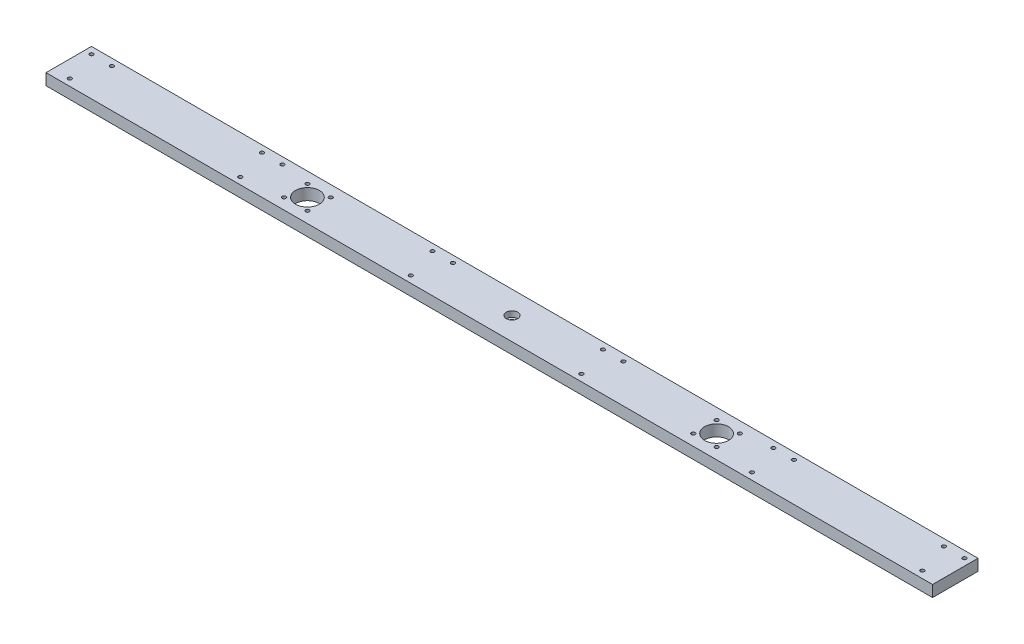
ISO-10303-21;
HEADER;
FILE_DESCRIPTION(('STEP AP214'),'2;1');
FILE_NAME('part.step','',(''),(''),'','','');
FILE_SCHEMA(('AUTOMOTIVE_DESIGN { 1 0 10303 214 1 1 1 1 }'));
ENDSEC;
DATA;
#1=APPLICATION_CONTEXT('core data for automotive mechanical design processes');
#2=APPLICATION_PROTOCOL_DEFINITION('international standard','automotive_design',2000,#1);
#3=PRODUCT_CONTEXT('',#1,'mechanical');
#4=PRODUCT('Part','Part','',(#3));
#5=PRODUCT_RELATED_PRODUCT_CATEGORY('part','',(#4));
#6=PRODUCT_DEFINITION_FORMATION('','',#4);
#7=PRODUCT_DEFINITION_CONTEXT('part definition',#1,'design');
#8=PRODUCT_DEFINITION('design','',#6,#7);
#9=PRODUCT_DEFINITION_SHAPE('','',#8);
#10=(LENGTH_UNIT() NAMED_UNIT(*) SI_UNIT(.MILLI.,.METRE.));
#11=(NAMED_UNIT(*) PLANE_ANGLE_UNIT() SI_UNIT($,.RADIAN.));
#12=(NAMED_UNIT(*) SI_UNIT($,.STERADIAN.) SOLID_ANGLE_UNIT());
#13=UNCERTAINTY_MEASURE_WITH_UNIT(LENGTH_MEASURE(1.E-05),#10,'distance_accuracy_value','');
#14=(GEOMETRIC_REPRESENTATION_CONTEXT(3) GLOBAL_UNCERTAINTY_ASSIGNED_CONTEXT((#13)) GLOBAL_UNIT_ASSIGNED_CONTEXT((#10,
#11,#12)) REPRESENTATION_CONTEXT('',''));
#15=CARTESIAN_POINT('',(0.,0.,0.));
#16=DIRECTION('',(0.,0.,1.));
#17=DIRECTION('',(1.,0.,0.));
#18=AXIS2_PLACEMENT_3D('',#15,#16,#17);
#19=CARTESIAN_POINT('',(0.,5.,0.));
#20=DIRECTION('',(0.,1.,0.));
#21=DIRECTION('',(0.,0.,1.));
#22=AXIS2_PLACEMENT_3D('',#19,#20,#21);
#23=CYLINDRICAL_SURFACE('',#22,5.);
#24=CARTESIAN_POINT('',(0.,10.,0.));
#25=DIRECTION('',(0.,1.,0.));
#26=DIRECTION('',(0.,0.,1.));
#27=AXIS2_PLACEMENT_3D('',#24,#25,#26);
#28=CIRCLE('',#27,5.);
#29=CARTESIAN_POINT('',(0.,10.,5.));
#30=VERTEX_POINT('',#29);
#31=EDGE_CURVE('E253',#30,#30,#28,.F.);
#32=ORIENTED_EDGE('',*,*,#31,.F.);
#33=EDGE_LOOP('',(#32));
#34=FACE_BOUND('',#33,.T.);
#35=CARTESIAN_POINT('',(0.,5.,0.));
#36=DIRECTION('',(0.,1.,0.));
#37=DIRECTION('',(0.,0.,1.));
#38=AXIS2_PLACEMENT_3D('',#35,#36,#37);
#39=CIRCLE('',#38,5.);
#40=CARTESIAN_POINT('',(0.,5.,5.));
#41=VERTEX_POINT('',#40);
#42=EDGE_CURVE('E20',#41,#41,#39,.T.);
#43=ORIENTED_EDGE('',*,*,#42,.F.);
#44=EDGE_LOOP('',(#43));
#45=FACE_BOUND('',#44,.T.);
#46=ADVANCED_FACE('F17',(#34,#45),#23,.F.);
#47=CARTESIAN_POINT('',(0.,5.,0.));
#48=DIRECTION('',(0.,1.,0.));
#49=DIRECTION('',(0.,0.,1.));
#50=AXIS2_PLACEMENT_3D('',#47,#48,#49);
#51=PLANE('',#50);
#52=CARTESIAN_POINT('',(0.,5.,0.));
#53=DIRECTION('',(0.,1.,0.));
#54=DIRECTION('',(0.,0.,1.));
#55=AXIS2_PLACEMENT_3D('',#52,#53,#54);
#56=CIRCLE('',#55,2.75);
#57=CARTESIAN_POINT('',(0.,5.,2.75));
#58=VERTEX_POINT('',#57);
#59=EDGE_CURVE('E68',#58,#58,#56,.F.);
#60=ORIENTED_EDGE('',*,*,#59,.T.);
#61=EDGE_LOOP('',(#60));
#62=FACE_BOUND('',#61,.T.);
#63=ORIENTED_EDGE('',*,*,#42,.T.);
#64=EDGE_LOOP('',(#63));
#65=FACE_BOUND('',#64,.T.);
#66=ADVANCED_FACE('F259',(#62,#65),#51,.T.);
#67=CARTESIAN_POINT('',(0.,10.,0.));
#68=DIRECTION('',(0.,1.,0.));
#69=DIRECTION('',(0.,0.,1.));
#70=AXIS2_PLACEMENT_3D('',#67,#68,#69);
#71=PLANE('',#70);
#72=CARTESIAN_POINT('',(383.999999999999,10.,-14.0000000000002));
#73=DIRECTION('',(0.,1.,0.));
#74=DIRECTION('',(0.,0.,1.));
#75=AXIS2_PLACEMENT_3D('',#72,#73,#74);
#76=CIRCLE('',#75,1.64999999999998);
#77=CARTESIAN_POINT('',(383.999999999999,10.,-12.3500000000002));
#78=VERTEX_POINT('',#77);
#79=EDGE_CURVE('E167',#78,#78,#76,.F.);
#80=ORIENTED_EDGE('',*,*,#79,.T.);
#81=EDGE_LOOP('',(#80));
#82=FACE_BOUND('',#81,.T.);
#83=CARTESIAN_POINT('',(233.999999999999,10.,-14.0000000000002));
#84=DIRECTION('',(0.,1.,0.));
#85=DIRECTION('',(0.,0.,1.));
#86=AXIS2_PLACEMENT_3D('',#83,#84,#85);
#87=CIRCLE('',#86,1.64999999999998);
#88=CARTESIAN_POINT('',(233.999999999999,10.,-12.3500000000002));
#89=VERTEX_POINT('',#88);
#90=EDGE_CURVE('E170',#89,#89,#87,.F.);
#91=ORIENTED_EDGE('',*,*,#90,.T.);
#92=EDGE_LOOP('',(#91));
#93=FACE_BOUND('',#92,.T.);
#94=CARTESIAN_POINT('',(83.9999999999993,10.,-14.0000000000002));
#95=DIRECTION('',(0.,1.,0.));
#96=DIRECTION('',(0.,0.,1.));
#97=AXIS2_PLACEMENT_3D('',#94,#95,#96);
#98=CIRCLE('',#97,1.64999999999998);
#99=CARTESIAN_POINT('',(83.9999999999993,10.,-12.3500000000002));
#100=VERTEX_POINT('',#99);
#101=EDGE_CURVE('E173',#100,#100,#98,.F.);
#102=ORIENTED_EDGE('',*,*,#101,.T.);
#103=EDGE_LOOP('',(#102));
#104=FACE_BOUND('',#103,.T.);
#105=CARTESIAN_POINT('',(-66.0000000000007,10.,-14.0000000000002));
#106=DIRECTION('',(0.,1.,0.));
#107=DIRECTION('',(0.,0.,1.));
#108=AXIS2_PLACEMENT_3D('',#105,#106,#107);
#109=CIRCLE('',#108,1.64999999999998);
#110=CARTESIAN_POINT('',(-66.0000000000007,10.,-12.3500000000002));
#111=VERTEX_POINT('',#110);
#112=EDGE_CURVE('E176',#111,#111,#109,.F.);
#113=ORIENTED_EDGE('',*,*,#112,.T.);
#114=EDGE_LOOP('',(#113));
#115=FACE_BOUND('',#114,.T.);
#116=CARTESIAN_POINT('',(374.999999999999,10.,13.9999999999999));
#117=DIRECTION('',(0.,1.,0.));
#118=DIRECTION('',(0.,0.,1.));
#119=AXIS2_PLACEMENT_3D('',#116,#117,#118);
#120=CIRCLE('',#119,1.64999999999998);
#121=CARTESIAN_POINT('',(374.999999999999,10.,15.6499999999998));
#122=VERTEX_POINT('',#121);
#123=EDGE_CURVE('E179',#122,#122,#120,.F.);
#124=ORIENTED_EDGE('',*,*,#123,.T.);
#125=EDGE_LOOP('',(#124));
#126=FACE_BOUND('',#125,.T.);
#127=CARTESIAN_POINT('',(224.999999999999,10.,13.9999999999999));
#128=DIRECTION('',(0.,1.,0.));
#129=DIRECTION('',(0.,0.,1.));
#130=AXIS2_PLACEMENT_3D('',#127,#128,#129);
#131=CIRCLE('',#130,1.64999999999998);
#132=CARTESIAN_POINT('',(224.999999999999,10.,15.6499999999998));
#133=VERTEX_POINT('',#132);
#134=EDGE_CURVE('E182',#133,#133,#131,.F.);
#135=ORIENTED_EDGE('',*,*,#134,.T.);
#136=EDGE_LOOP('',(#135));
#137=FACE_BOUND('',#136,.T.);
#138=CARTESIAN_POINT('',(74.9999999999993,10.,13.9999999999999));
#139=DIRECTION('',(0.,1.,0.));
#140=DIRECTION('',(0.,0.,1.));
#141=AXIS2_PLACEMENT_3D('',#138,#139,#140);
#142=CIRCLE('',#141,1.64999999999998);
#143=CARTESIAN_POINT('',(74.9999999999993,10.,15.6499999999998));
#144=VERTEX_POINT('',#143);
#145=EDGE_CURVE('E185',#144,#144,#142,.F.);
#146=ORIENTED_EDGE('',*,*,#145,.T.);
#147=EDGE_LOOP('',(#146));
#148=FACE_BOUND('',#147,.T.);
#149=CARTESIAN_POINT('',(-75.0000000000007,10.,13.9999999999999));
#150=DIRECTION('',(0.,1.,0.));
#151=DIRECTION('',(0.,0.,1.));
#152=AXIS2_PLACEMENT_3D('',#149,#150,#151);
#153=CIRCLE('',#152,1.64999999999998);
#154=CARTESIAN_POINT('',(-75.0000000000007,10.,15.6499999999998));
#155=VERTEX_POINT('',#154);
#156=EDGE_CURVE('E188',#155,#155,#153,.F.);
#157=ORIENTED_EDGE('',*,*,#156,.T.);
#158=EDGE_LOOP('',(#157));
#159=FACE_BOUND('',#158,.T.);
#160=CARTESIAN_POINT('',(365.999999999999,10.,-14.0000000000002));
#161=DIRECTION('',(0.,1.,0.));
#162=DIRECTION('',(0.,0.,1.));
#163=AXIS2_PLACEMENT_3D('',#160,#161,#162);
#164=CIRCLE('',#163,1.64999999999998);
#165=CARTESIAN_POINT('',(365.999999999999,10.,-12.3500000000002));
#166=VERTEX_POINT('',#165);
#167=EDGE_CURVE('E191',#166,#166,#164,.F.);
#168=ORIENTED_EDGE('',*,*,#167,.T.);
#169=EDGE_LOOP('',(#168));
#170=FACE_BOUND('',#169,.T.);
#171=CARTESIAN_POINT('',(215.999999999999,10.,-14.0000000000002));
#172=DIRECTION('',(0.,1.,0.));
#173=DIRECTION('',(0.,0.,1.));
#174=AXIS2_PLACEMENT_3D('',#171,#172,#173);
#175=CIRCLE('',#174,1.64999999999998);
#176=CARTESIAN_POINT('',(215.999999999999,10.,-12.3500000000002));
#177=VERTEX_POINT('',#176);
#178=EDGE_CURVE('E194',#177,#177,#175,.F.);
#179=ORIENTED_EDGE('',*,*,#178,.T.);
#180=EDGE_LOOP('',(#179));
#181=FACE_BOUND('',#180,.T.);
#182=CARTESIAN_POINT('',(65.9999999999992,10.,-14.0000000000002));
#183=DIRECTION('',(0.,1.,0.));
#184=DIRECTION('',(0.,0.,1.));
#185=AXIS2_PLACEMENT_3D('',#182,#183,#184);
#186=CIRCLE('',#185,1.64999999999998);
#187=CARTESIAN_POINT('',(65.9999999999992,10.,-12.3500000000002));
#188=VERTEX_POINT('',#187);
#189=EDGE_CURVE('E197',#188,#188,#186,.F.);
#190=ORIENTED_EDGE('',*,*,#189,.T.);
#191=EDGE_LOOP('',(#190));
#192=FACE_BOUND('',#191,.T.);
#193=CARTESIAN_POINT('',(-84.0000000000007,10.,-14.0000000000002));
#194=DIRECTION('',(0.,1.,0.));
#195=DIRECTION('',(0.,0.,1.));
#196=AXIS2_PLACEMENT_3D('',#193,#194,#195);
#197=CIRCLE('',#196,1.64999999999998);
#198=CARTESIAN_POINT('',(-84.0000000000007,10.,-12.3500000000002));
#199=VERTEX_POINT('',#198);
#200=EDGE_CURVE('E200',#199,#199,#197,.F.);
#201=ORIENTED_EDGE('',*,*,#200,.T.);
#202=EDGE_LOOP('',(#201));
#203=FACE_BOUND('',#202,.T.);
#204=DIRECTION('',(0.,0.,-1.));
#205=VECTOR('',#204,1.);
#206=CARTESIAN_POINT('',(-390.,10.,-20.));
#207=LINE('',#206,#205);
#208=CARTESIAN_POINT('',(-390.,10.,-20.));
#209=VERTEX_POINT('',#208);
#210=CARTESIAN_POINT('',(-390.,10.,20.));
#211=VERTEX_POINT('',#210);
#212=EDGE_CURVE('E56',#209,#211,#207,.F.);
#213=ORIENTED_EDGE('',*,*,#212,.T.);
#214=DIRECTION('',(-1.,0.,0.));
#215=VECTOR('',#214,1.);
#216=CARTESIAN_POINT('',(-390.,10.,20.));
#217=LINE('',#216,#215);
#218=CARTESIAN_POINT('',(390.,10.,20.));
#219=VERTEX_POINT('',#218);
#220=EDGE_CURVE('E830',#211,#219,#217,.F.);
#221=ORIENTED_EDGE('',*,*,#220,.T.);
#222=DIRECTION('',(0.,0.,1.));
#223=VECTOR('',#222,1.);
#224=CARTESIAN_POINT('',(390.,10.,-20.));
#225=LINE('',#224,#223);
#226=CARTESIAN_POINT('',(390.,10.,-20.));
#227=VERTEX_POINT('',#226);
#228=EDGE_CURVE('E62',#219,#227,#225,.F.);
#229=ORIENTED_EDGE('',*,*,#228,.T.);
#230=DIRECTION('',(1.,0.,0.));
#231=VECTOR('',#230,1.);
#232=CARTESIAN_POINT('',(-390.,10.,-20.));
#233=LINE('',#232,#231);
#234=EDGE_CURVE('E59',#227,#209,#233,.F.);
#235=ORIENTED_EDGE('',*,*,#234,.T.);
#236=EDGE_LOOP('',(#213,#221,#229,#235));
#237=FACE_BOUND('',#236,.T.);
#238=ORIENTED_EDGE('',*,*,#31,.T.);
#239=EDGE_LOOP('',(#238));
#240=FACE_BOUND('',#239,.T.);
#241=CARTESIAN_POINT('',(-180.,10.,0.));
#242=DIRECTION('',(0.,1.,0.));
#243=DIRECTION('',(0.,0.,1.));
#244=AXIS2_PLACEMENT_3D('',#241,#242,#243);
#245=CIRCLE('',#244,10.5);
#246=CARTESIAN_POINT('',(-180.,10.,10.5));
#247=VERTEX_POINT('',#246);
#248=EDGE_CURVE('E206',#247,#247,#245,.F.);
#249=ORIENTED_EDGE('',*,*,#248,.T.);
#250=EDGE_LOOP('',(#249));
#251=FACE_BOUND('',#250,.T.);
#252=CARTESIAN_POINT('',(180.,10.,0.));
#253=DIRECTION('',(0.,1.,0.));
#254=DIRECTION('',(0.,0.,1.));
#255=AXIS2_PLACEMENT_3D('',#252,#253,#254);
#256=CIRCLE('',#255,10.5);
#257=CARTESIAN_POINT('',(180.,10.,10.5));
#258=VERTEX_POINT('',#257);
#259=EDGE_CURVE('E209',#258,#258,#256,.F.);
#260=ORIENTED_EDGE('',*,*,#259,.T.);
#261=EDGE_LOOP('',(#260));
#262=FACE_BOUND('',#261,.T.);
#263=CARTESIAN_POINT('',(169.746951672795,10.,-10.2530483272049));
#264=DIRECTION('',(0.,1.,0.));
#265=DIRECTION('',(0.,0.,1.));
#266=AXIS2_PLACEMENT_3D('',#263,#264,#265);
#267=CIRCLE('',#266,1.64999999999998);
#268=CARTESIAN_POINT('',(169.746951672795,10.,-8.60304832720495));
#269=VERTEX_POINT('',#268);
#270=EDGE_CURVE('E212',#269,#269,#267,.F.);
#271=ORIENTED_EDGE('',*,*,#270,.T.);
#272=EDGE_LOOP('',(#271));
#273=FACE_BOUND('',#272,.T.);
#274=CARTESIAN_POINT('',(-190.253048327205,10.,-10.253048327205));
#275=DIRECTION('',(0.,1.,0.));
#276=DIRECTION('',(0.,0.,1.));
#277=AXIS2_PLACEMENT_3D('',#274,#275,#276);
#278=CIRCLE('',#277,1.64999999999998);
#279=CARTESIAN_POINT('',(-190.253048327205,10.,-8.60304832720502));
#280=VERTEX_POINT('',#279);
#281=EDGE_CURVE('E215',#280,#280,#278,.F.);
#282=ORIENTED_EDGE('',*,*,#281,.T.);
#283=EDGE_LOOP('',(#282));
#284=FACE_BOUND('',#283,.T.);
#285=CARTESIAN_POINT('',(169.746951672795,10.,10.2469516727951));
#286=DIRECTION('',(0.,1.,0.));
#287=DIRECTION('',(0.,0.,1.));
#288=AXIS2_PLACEMENT_3D('',#285,#286,#287);
#289=CIRCLE('',#288,1.64999999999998);
#290=CARTESIAN_POINT('',(169.746951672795,10.,11.8969516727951));
#291=VERTEX_POINT('',#290);
#292=EDGE_CURVE('E218',#291,#291,#289,.F.);
#293=ORIENTED_EDGE('',*,*,#292,.T.);
#294=EDGE_LOOP('',(#293));
#295=FACE_BOUND('',#294,.T.);
#296=CARTESIAN_POINT('',(-190.253048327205,10.,10.246951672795));
#297=DIRECTION('',(0.,1.,0.));
#298=DIRECTION('',(0.,0.,1.));
#299=AXIS2_PLACEMENT_3D('',#296,#297,#298);
#300=CIRCLE('',#299,1.64999999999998);
#301=CARTESIAN_POINT('',(-190.253048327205,10.,11.896951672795));
#302=VERTEX_POINT('',#301);
#303=EDGE_CURVE('E221',#302,#302,#300,.F.);
#304=ORIENTED_EDGE('',*,*,#303,.T.);
#305=EDGE_LOOP('',(#304));
#306=FACE_BOUND('',#305,.T.);
#307=CARTESIAN_POINT('',(190.246951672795,10.,-10.2530483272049));
#308=DIRECTION('',(0.,1.,0.));
#309=DIRECTION('',(0.,0.,1.));
#310=AXIS2_PLACEMENT_3D('',#307,#308,#309);
#311=CIRCLE('',#310,1.64999999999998);
#312=CARTESIAN_POINT('',(190.246951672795,10.,-8.60304832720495));
#313=VERTEX_POINT('',#312);
#314=EDGE_CURVE('E224',#313,#313,#311,.F.);
#315=ORIENTED_EDGE('',*,*,#314,.T.);
#316=EDGE_LOOP('',(#315));
#317=FACE_BOUND('',#316,.T.);
#318=CARTESIAN_POINT('',(-169.753048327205,10.,-10.253048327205));
#319=DIRECTION('',(0.,1.,0.));
#320=DIRECTION('',(0.,0.,1.));
#321=AXIS2_PLACEMENT_3D('',#318,#319,#320);
#322=CIRCLE('',#321,1.64999999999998);
#323=CARTESIAN_POINT('',(-169.753048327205,10.,-8.60304832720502));
#324=VERTEX_POINT('',#323);
#325=EDGE_CURVE('E227',#324,#324,#322,.F.);
#326=ORIENTED_EDGE('',*,*,#325,.T.);
#327=EDGE_LOOP('',(#326));
#328=FACE_BOUND('',#327,.T.);
#329=CARTESIAN_POINT('',(190.246951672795,10.,10.2469516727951));
#330=DIRECTION('',(0.,1.,0.));
#331=DIRECTION('',(0.,0.,1.));
#332=AXIS2_PLACEMENT_3D('',#329,#330,#331);
#333=CIRCLE('',#332,1.64999999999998);
#334=CARTESIAN_POINT('',(190.246951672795,10.,11.8969516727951));
#335=VERTEX_POINT('',#334);
#336=EDGE_CURVE('E230',#335,#335,#333,.F.);
#337=ORIENTED_EDGE('',*,*,#336,.T.);
#338=EDGE_LOOP('',(#337));
#339=FACE_BOUND('',#338,.T.);
#340=CARTESIAN_POINT('',(-169.753048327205,10.,10.246951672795));
#341=DIRECTION('',(0.,1.,0.));
#342=DIRECTION('',(0.,0.,1.));
#343=AXIS2_PLACEMENT_3D('',#340,#341,#342);
#344=CIRCLE('',#343,1.64999999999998);
#345=CARTESIAN_POINT('',(-169.753048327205,10.,11.896951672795));
#346=VERTEX_POINT('',#345);
#347=EDGE_CURVE('E233',#346,#346,#344,.F.);
#348=ORIENTED_EDGE('',*,*,#347,.T.);
#349=EDGE_LOOP('',(#348));
#350=FACE_BOUND('',#349,.T.);
#351=CARTESIAN_POINT('',(-375.000000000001,10.,13.9999999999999));
#352=DIRECTION('',(0.,1.,0.));
#353=DIRECTION('',(0.,0.,1.));
#354=AXIS2_PLACEMENT_3D('',#351,#352,#353);
#355=CIRCLE('',#354,1.64999999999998);
#356=CARTESIAN_POINT('',(-375.000000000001,10.,15.6499999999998));
#357=VERTEX_POINT('',#356);
#358=EDGE_CURVE('E236',#357,#357,#355,.F.);
#359=ORIENTED_EDGE('',*,*,#358,.T.);
#360=EDGE_LOOP('',(#359));
#361=FACE_BOUND('',#360,.T.);
#362=CARTESIAN_POINT('',(-366.000000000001,10.,-14.0000000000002));
#363=DIRECTION('',(0.,1.,0.));
#364=DIRECTION('',(0.,0.,1.));
#365=AXIS2_PLACEMENT_3D('',#362,#363,#364);
#366=CIRCLE('',#365,1.64999999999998);
#367=CARTESIAN_POINT('',(-366.000000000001,10.,-12.3500000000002));
#368=VERTEX_POINT('',#367);
#369=EDGE_CURVE('E239',#368,#368,#366,.F.);
#370=ORIENTED_EDGE('',*,*,#369,.T.);
#371=EDGE_LOOP('',(#370));
#372=FACE_BOUND('',#371,.T.);
#373=CARTESIAN_POINT('',(-384.000000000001,10.,-14.0000000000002));
#374=DIRECTION('',(0.,1.,0.));
#375=DIRECTION('',(0.,0.,1.));
#376=AXIS2_PLACEMENT_3D('',#373,#374,#375);
#377=CIRCLE('',#376,1.64999999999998);
#378=CARTESIAN_POINT('',(-384.000000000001,10.,-12.3500000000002));
#379=VERTEX_POINT('',#378);
#380=EDGE_CURVE('E242',#379,#379,#377,.F.);
#381=ORIENTED_EDGE('',*,*,#380,.T.);
#382=EDGE_LOOP('',(#381));
#383=FACE_BOUND('',#382,.T.);
#384=CARTESIAN_POINT('',(-234.000000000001,10.,-14.0000000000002));
#385=DIRECTION('',(0.,1.,0.));
#386=DIRECTION('',(0.,0.,1.));
#387=AXIS2_PLACEMENT_3D('',#384,#385,#386);
#388=CIRCLE('',#387,1.64999999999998);
#389=CARTESIAN_POINT('',(-234.000000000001,10.,-12.3500000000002));
#390=VERTEX_POINT('',#389);
#391=EDGE_CURVE('E245',#390,#390,#388,.F.);
#392=ORIENTED_EDGE('',*,*,#391,.T.);
#393=EDGE_LOOP('',(#392));
#394=FACE_BOUND('',#393,.T.);
#395=CARTESIAN_POINT('',(-225.000000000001,10.,13.9999999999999));
#396=DIRECTION('',(0.,1.,0.));
#397=DIRECTION('',(0.,0.,1.));
#398=AXIS2_PLACEMENT_3D('',#395,#396,#397);
#399=CIRCLE('',#398,1.64999999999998);
#400=CARTESIAN_POINT('',(-225.000000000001,10.,15.6499999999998));
#401=VERTEX_POINT('',#400);
#402=EDGE_CURVE('E248',#401,#401,#399,.F.);
#403=ORIENTED_EDGE('',*,*,#402,.T.);
#404=EDGE_LOOP('',(#403));
#405=FACE_BOUND('',#404,.T.);
#406=CARTESIAN_POINT('',(-216.000000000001,10.,-14.0000000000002));
#407=DIRECTION('',(0.,1.,0.));
#408=DIRECTION('',(0.,0.,1.));
#409=AXIS2_PLACEMENT_3D('',#406,#407,#408);
#410=CIRCLE('',#409,1.64999999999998);
#411=CARTESIAN_POINT('',(-216.000000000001,10.,-12.3500000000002));
#412=VERTEX_POINT('',#411);
#413=EDGE_CURVE('E251',#412,#412,#410,.F.);
#414=ORIENTED_EDGE('',*,*,#413,.T.);
#415=EDGE_LOOP('',(#414));
#416=FACE_BOUND('',#415,.T.);
#417=ADVANCED_FACE('F60',(#82,#93,#104,#115,#126,#137,#148,#159,#170,#181,#192,#203,#237,#240,
#251,#262,#273,#284,#295,#306,#317,#328,#339,#350,#361,#372,#383,#394,#405,#416),#71,.T.);
#418=CARTESIAN_POINT('',(-216.000000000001,10.,-14.0000000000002));
#419=DIRECTION('',(0.,1.,0.));
#420=DIRECTION('',(0.,0.,1.));
#421=AXIS2_PLACEMENT_3D('',#418,#419,#420);
#422=CYLINDRICAL_SURFACE('',#421,1.64999999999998);
#423=CARTESIAN_POINT('',(-216.000000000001,0.,-14.0000000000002));
#424=DIRECTION('',(0.,1.,0.));
#425=DIRECTION('',(0.,0.,1.));
#426=AXIS2_PLACEMENT_3D('',#423,#424,#425);
#427=CIRCLE('',#426,1.64999999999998);
#428=CARTESIAN_POINT('',(-216.000000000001,0.,-12.3500000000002));
#429=VERTEX_POINT('',#428);
#430=EDGE_CURVE('E164',#429,#429,#427,.F.);
#431=ORIENTED_EDGE('',*,*,#430,.T.);
#432=EDGE_LOOP('',(#431));
#433=FACE_BOUND('',#432,.T.);
#434=ORIENTED_EDGE('',*,*,#413,.F.);
#435=EDGE_LOOP('',(#434));
#436=FACE_BOUND('',#435,.T.);
#437=ADVANCED_FACE('F399',(#433,#436),#422,.F.);
#438=CARTESIAN_POINT('',(-225.000000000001,10.,13.9999999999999));
#439=DIRECTION('',(0.,1.,0.));
#440=DIRECTION('',(0.,0.,1.));
#441=AXIS2_PLACEMENT_3D('',#438,#439,#440);
#442=CYLINDRICAL_SURFACE('',#441,1.64999999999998);
#443=CARTESIAN_POINT('',(-225.000000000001,0.,13.9999999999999));
#444=DIRECTION('',(0.,1.,0.));
#445=DIRECTION('',(0.,0.,1.));
#446=AXIS2_PLACEMENT_3D('',#443,#444,#445);
#447=CIRCLE('',#446,1.64999999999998);
#448=CARTESIAN_POINT('',(-225.000000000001,0.,15.6499999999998));
#449=VERTEX_POINT('',#448);
#450=EDGE_CURVE('E161',#449,#449,#447,.F.);
#451=ORIENTED_EDGE('',*,*,#450,.T.);
#452=EDGE_LOOP('',(#451));
#453=FACE_BOUND('',#452,.T.);
#454=ORIENTED_EDGE('',*,*,#402,.F.);
#455=EDGE_LOOP('',(#454));
#456=FACE_BOUND('',#455,.T.);
#457=ADVANCED_FACE('F395',(#453,#456),#442,.F.);
#458=CARTESIAN_POINT('',(-234.000000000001,10.,-14.0000000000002));
#459=DIRECTION('',(0.,1.,0.));
#460=DIRECTION('',(0.,0.,1.));
#461=AXIS2_PLACEMENT_3D('',#458,#459,#460);
#462=CYLINDRICAL_SURFACE('',#461,1.64999999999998);
#463=CARTESIAN_POINT('',(-234.000000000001,0.,-14.0000000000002));
#464=DIRECTION('',(0.,1.,0.));
#465=DIRECTION('',(0.,0.,1.));
#466=AXIS2_PLACEMENT_3D('',#463,#464,#465);
#467=CIRCLE('',#466,1.64999999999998);
#468=CARTESIAN_POINT('',(-234.000000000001,0.,-12.3500000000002));
#469=VERTEX_POINT('',#468);
#470=EDGE_CURVE('E158',#469,#469,#467,.F.);
#471=ORIENTED_EDGE('',*,*,#470,.T.);
#472=EDGE_LOOP('',(#471));
#473=FACE_BOUND('',#472,.T.);
#474=ORIENTED_EDGE('',*,*,#391,.F.);
#475=EDGE_LOOP('',(#474));
#476=FACE_BOUND('',#475,.T.);
#477=ADVANCED_FACE('F391',(#473,#476),#462,.F.);
#478=CARTESIAN_POINT('',(-384.000000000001,10.,-14.0000000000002));
#479=DIRECTION('',(0.,1.,0.));
#480=DIRECTION('',(0.,0.,1.));
#481=AXIS2_PLACEMENT_3D('',#478,#479,#480);
#482=CYLINDRICAL_SURFACE('',#481,1.64999999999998);
#483=CARTESIAN_POINT('',(-384.000000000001,0.,-14.0000000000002));
#484=DIRECTION('',(0.,1.,0.));
#485=DIRECTION('',(0.,0.,1.));
#486=AXIS2_PLACEMENT_3D('',#483,#484,#485);
#487=CIRCLE('',#486,1.64999999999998);
#488=CARTESIAN_POINT('',(-384.000000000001,0.,-12.3500000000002));
#489=VERTEX_POINT('',#488);
#490=EDGE_CURVE('E155',#489,#489,#487,.F.);
#491=ORIENTED_EDGE('',*,*,#490,.T.);
#492=EDGE_LOOP('',(#491));
#493=FACE_BOUND('',#492,.T.);
#494=ORIENTED_EDGE('',*,*,#380,.F.);
#495=EDGE_LOOP('',(#494));
#496=FACE_BOUND('',#495,.T.);
#497=ADVANCED_FACE('F387',(#493,#496),#482,.F.);
#498=CARTESIAN_POINT('',(-366.000000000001,10.,-14.0000000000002));
#499=DIRECTION('',(0.,1.,0.));
#500=DIRECTION('',(0.,0.,1.));
#501=AXIS2_PLACEMENT_3D('',#498,#499,#500);
#502=CYLINDRICAL_SURFACE('',#501,1.64999999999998);
#503=CARTESIAN_POINT('',(-366.000000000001,0.,-14.0000000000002));
#504=DIRECTION('',(0.,1.,0.));
#505=DIRECTION('',(0.,0.,1.));
#506=AXIS2_PLACEMENT_3D('',#503,#504,#505);
#507=CIRCLE('',#506,1.64999999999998);
#508=CARTESIAN_POINT('',(-366.000000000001,0.,-12.3500000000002));
#509=VERTEX_POINT('',#508);
#510=EDGE_CURVE('E152',#509,#509,#507,.F.);
#511=ORIENTED_EDGE('',*,*,#510,.T.);
#512=EDGE_LOOP('',(#511));
#513=FACE_BOUND('',#512,.T.);
#514=ORIENTED_EDGE('',*,*,#369,.F.);
#515=EDGE_LOOP('',(#514));
#516=FACE_BOUND('',#515,.T.);
#517=ADVANCED_FACE('F383',(#513,#516),#502,.F.);
#518=CARTESIAN_POINT('',(-375.000000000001,10.,13.9999999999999));
#519=DIRECTION('',(0.,1.,0.));
#520=DIRECTION('',(0.,0.,1.));
#521=AXIS2_PLACEMENT_3D('',#518,#519,#520);
#522=CYLINDRICAL_SURFACE('',#521,1.64999999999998);
#523=CARTESIAN_POINT('',(-375.000000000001,0.,13.9999999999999));
#524=DIRECTION('',(0.,1.,0.));
#525=DIRECTION('',(0.,0.,1.));
#526=AXIS2_PLACEMENT_3D('',#523,#524,#525);
#527=CIRCLE('',#526,1.64999999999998);
#528=CARTESIAN_POINT('',(-375.000000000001,0.,15.6499999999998));
#529=VERTEX_POINT('',#528);
#530=EDGE_CURVE('E149',#529,#529,#527,.F.);
#531=ORIENTED_EDGE('',*,*,#530,.T.);
#532=EDGE_LOOP('',(#531));
#533=FACE_BOUND('',#532,.T.);
#534=ORIENTED_EDGE('',*,*,#358,.F.);
#535=EDGE_LOOP('',(#534));
#536=FACE_BOUND('',#535,.T.);
#537=ADVANCED_FACE('F379',(#533,#536),#522,.F.);
#538=CARTESIAN_POINT('',(-169.753048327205,10.,10.246951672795));
#539=DIRECTION('',(0.,1.,0.));
#540=DIRECTION('',(0.,0.,1.));
#541=AXIS2_PLACEMENT_3D('',#538,#539,#540);
#542=CYLINDRICAL_SURFACE('',#541,1.64999999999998);
#543=CARTESIAN_POINT('',(-169.753048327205,0.,10.246951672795));
#544=DIRECTION('',(0.,1.,0.));
#545=DIRECTION('',(0.,0.,1.));
#546=AXIS2_PLACEMENT_3D('',#543,#544,#545);
#547=CIRCLE('',#546,1.64999999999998);
#548=CARTESIAN_POINT('',(-169.753048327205,0.,11.896951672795));
#549=VERTEX_POINT('',#548);
#550=EDGE_CURVE('E146',#549,#549,#547,.F.);
#551=ORIENTED_EDGE('',*,*,#550,.T.);
#552=EDGE_LOOP('',(#551));
#553=FACE_BOUND('',#552,.T.);
#554=ORIENTED_EDGE('',*,*,#347,.F.);
#555=EDGE_LOOP('',(#554));
#556=FACE_BOUND('',#555,.T.);
#557=ADVANCED_FACE('F375',(#553,#556),#542,.F.);
#558=CARTESIAN_POINT('',(190.246951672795,10.,10.2469516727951));
#559=DIRECTION('',(0.,1.,0.));
#560=DIRECTION('',(0.,0.,1.));
#561=AXIS2_PLACEMENT_3D('',#558,#559,#560);
#562=CYLINDRICAL_SURFACE('',#561,1.64999999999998);
#563=CARTESIAN_POINT('',(190.246951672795,0.,10.2469516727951));
#564=DIRECTION('',(0.,1.,0.));
#565=DIRECTION('',(0.,0.,1.));
#566=AXIS2_PLACEMENT_3D('',#563,#564,#565);
#567=CIRCLE('',#566,1.64999999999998);
#568=CARTESIAN_POINT('',(190.246951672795,0.,11.8969516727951));
#569=VERTEX_POINT('',#568);
#570=EDGE_CURVE('E143',#569,#569,#567,.F.);
#571=ORIENTED_EDGE('',*,*,#570,.T.);
#572=EDGE_LOOP('',(#571));
#573=FACE_BOUND('',#572,.T.);
#574=ORIENTED_EDGE('',*,*,#336,.F.);
#575=EDGE_LOOP('',(#574));
#576=FACE_BOUND('',#575,.T.);
#577=ADVANCED_FACE('F371',(#573,#576),#562,.F.);
#578=CARTESIAN_POINT('',(-169.753048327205,10.,-10.253048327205));
#579=DIRECTION('',(0.,1.,0.));
#580=DIRECTION('',(0.,0.,1.));
#581=AXIS2_PLACEMENT_3D('',#578,#579,#580);
#582=CYLINDRICAL_SURFACE('',#581,1.64999999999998);
#583=CARTESIAN_POINT('',(-169.753048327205,0.,-10.253048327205));
#584=DIRECTION('',(0.,1.,0.));
#585=DIRECTION('',(0.,0.,1.));
#586=AXIS2_PLACEMENT_3D('',#583,#584,#585);
#587=CIRCLE('',#586,1.64999999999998);
#588=CARTESIAN_POINT('',(-169.753048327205,0.,-8.60304832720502));
#589=VERTEX_POINT('',#588);
#590=EDGE_CURVE('E140',#589,#589,#587,.F.);
#591=ORIENTED_EDGE('',*,*,#590,.T.);
#592=EDGE_LOOP('',(#591));
#593=FACE_BOUND('',#592,.T.);
#594=ORIENTED_EDGE('',*,*,#325,.F.);
#595=EDGE_LOOP('',(#594));
#596=FACE_BOUND('',#595,.T.);
#597=ADVANCED_FACE('F367',(#593,#596),#582,.F.);
#598=CARTESIAN_POINT('',(190.246951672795,10.,-10.2530483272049));
#599=DIRECTION('',(0.,1.,0.));
#600=DIRECTION('',(0.,0.,1.));
#601=AXIS2_PLACEMENT_3D('',#598,#599,#600);
#602=CYLINDRICAL_SURFACE('',#601,1.64999999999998);
#603=CARTESIAN_POINT('',(190.246951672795,0.,-10.2530483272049));
#604=DIRECTION('',(0.,1.,0.));
#605=DIRECTION('',(0.,0.,1.));
#606=AXIS2_PLACEMENT_3D('',#603,#604,#605);
#607=CIRCLE('',#606,1.64999999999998);
#608=CARTESIAN_POINT('',(190.246951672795,0.,-8.60304832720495));
#609=VERTEX_POINT('',#608);
#610=EDGE_CURVE('E137',#609,#609,#607,.F.);
#611=ORIENTED_EDGE('',*,*,#610,.T.);
#612=EDGE_LOOP('',(#611));
#613=FACE_BOUND('',#612,.T.);
#614=ORIENTED_EDGE('',*,*,#314,.F.);
#615=EDGE_LOOP('',(#614));
#616=FACE_BOUND('',#615,.T.);
#617=ADVANCED_FACE('F363',(#613,#616),#602,.F.);
#618=CARTESIAN_POINT('',(-190.253048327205,10.,10.246951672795));
#619=DIRECTION('',(0.,1.,0.));
#620=DIRECTION('',(0.,0.,1.));
#621=AXIS2_PLACEMENT_3D('',#618,#619,#620);
#622=CYLINDRICAL_SURFACE('',#621,1.64999999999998);
#623=CARTESIAN_POINT('',(-190.253048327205,0.,10.246951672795));
#624=DIRECTION('',(0.,1.,0.));
#625=DIRECTION('',(0.,0.,1.));
#626=AXIS2_PLACEMENT_3D('',#623,#624,#625);
#627=CIRCLE('',#626,1.64999999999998);
#628=CARTESIAN_POINT('',(-190.253048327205,0.,11.896951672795));
#629=VERTEX_POINT('',#628);
#630=EDGE_CURVE('E134',#629,#629,#627,.F.);
#631=ORIENTED_EDGE('',*,*,#630,.T.);
#632=EDGE_LOOP('',(#631));
#633=FACE_BOUND('',#632,.T.);
#634=ORIENTED_EDGE('',*,*,#303,.F.);
#635=EDGE_LOOP('',(#634));
#636=FACE_BOUND('',#635,.T.);
#637=ADVANCED_FACE('F359',(#633,#636),#622,.F.);
#638=CARTESIAN_POINT('',(169.746951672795,10.,10.2469516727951));
#639=DIRECTION('',(0.,1.,0.));
#640=DIRECTION('',(0.,0.,1.));
#641=AXIS2_PLACEMENT_3D('',#638,#639,#640);
#642=CYLINDRICAL_SURFACE('',#641,1.64999999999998);
#643=CARTESIAN_POINT('',(169.746951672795,0.,10.2469516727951));
#644=DIRECTION('',(0.,1.,0.));
#645=DIRECTION('',(0.,0.,1.));
#646=AXIS2_PLACEMENT_3D('',#643,#644,#645);
#647=CIRCLE('',#646,1.64999999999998);
#648=CARTESIAN_POINT('',(169.746951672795,0.,11.8969516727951));
#649=VERTEX_POINT('',#648);
#650=EDGE_CURVE('E131',#649,#649,#647,.F.);
#651=ORIENTED_EDGE('',*,*,#650,.T.);
#652=EDGE_LOOP('',(#651));
#653=FACE_BOUND('',#652,.T.);
#654=ORIENTED_EDGE('',*,*,#292,.F.);
#655=EDGE_LOOP('',(#654));
#656=FACE_BOUND('',#655,.T.);
#657=ADVANCED_FACE('F355',(#653,#656),#642,.F.);
#658=CARTESIAN_POINT('',(-190.253048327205,10.,-10.253048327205));
#659=DIRECTION('',(0.,1.,0.));
#660=DIRECTION('',(0.,0.,1.));
#661=AXIS2_PLACEMENT_3D('',#658,#659,#660);
#662=CYLINDRICAL_SURFACE('',#661,1.64999999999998);
#663=CARTESIAN_POINT('',(-190.253048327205,0.,-10.253048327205));
#664=DIRECTION('',(0.,1.,0.));
#665=DIRECTION('',(0.,0.,1.));
#666=AXIS2_PLACEMENT_3D('',#663,#664,#665);
#667=CIRCLE('',#666,1.64999999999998);
#668=CARTESIAN_POINT('',(-190.253048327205,0.,-8.60304832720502));
#669=VERTEX_POINT('',#668);
#670=EDGE_CURVE('E128',#669,#669,#667,.F.);
#671=ORIENTED_EDGE('',*,*,#670,.T.);
#672=EDGE_LOOP('',(#671));
#673=FACE_BOUND('',#672,.T.);
#674=ORIENTED_EDGE('',*,*,#281,.F.);
#675=EDGE_LOOP('',(#674));
#676=FACE_BOUND('',#675,.T.);
#677=ADVANCED_FACE('F351',(#673,#676),#662,.F.);
#678=CARTESIAN_POINT('',(169.746951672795,10.,-10.2530483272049));
#679=DIRECTION('',(0.,1.,0.));
#680=DIRECTION('',(0.,0.,1.));
#681=AXIS2_PLACEMENT_3D('',#678,#679,#680);
#682=CYLINDRICAL_SURFACE('',#681,1.64999999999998);
#683=CARTESIAN_POINT('',(169.746951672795,0.,-10.2530483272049));
#684=DIRECTION('',(0.,1.,0.));
#685=DIRECTION('',(0.,0.,1.));
#686=AXIS2_PLACEMENT_3D('',#683,#684,#685);
#687=CIRCLE('',#686,1.64999999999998);
#688=CARTESIAN_POINT('',(169.746951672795,0.,-8.60304832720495));
#689=VERTEX_POINT('',#688);
#690=EDGE_CURVE('E125',#689,#689,#687,.F.);
#691=ORIENTED_EDGE('',*,*,#690,.T.);
#692=EDGE_LOOP('',(#691));
#693=FACE_BOUND('',#692,.T.);
#694=ORIENTED_EDGE('',*,*,#270,.F.);
#695=EDGE_LOOP('',(#694));
#696=FACE_BOUND('',#695,.T.);
#697=ADVANCED_FACE('F347',(#693,#696),#682,.F.);
#698=CARTESIAN_POINT('',(180.,0.,0.));
#699=DIRECTION('',(0.,1.,0.));
#700=DIRECTION('',(0.,0.,1.));
#701=AXIS2_PLACEMENT_3D('',#698,#699,#700);
#702=CYLINDRICAL_SURFACE('',#701,10.5);
#703=CARTESIAN_POINT('',(180.,0.,0.));
#704=DIRECTION('',(0.,1.,0.));
#705=DIRECTION('',(0.,0.,1.));
#706=AXIS2_PLACEMENT_3D('',#703,#704,#705);
#707=CIRCLE('',#706,10.5);
#708=CARTESIAN_POINT('',(180.,0.,10.5));
#709=VERTEX_POINT('',#708);
#710=EDGE_CURVE('E122',#709,#709,#707,.F.);
#711=ORIENTED_EDGE('',*,*,#710,.T.);
#712=EDGE_LOOP('',(#711));
#713=FACE_BOUND('',#712,.T.);
#714=ORIENTED_EDGE('',*,*,#259,.F.);
#715=EDGE_LOOP('',(#714));
#716=FACE_BOUND('',#715,.T.);
#717=ADVANCED_FACE('F343',(#713,#716),#702,.F.);
#718=CARTESIAN_POINT('',(-180.,0.,0.));
#719=DIRECTION('',(0.,1.,0.));
#720=DIRECTION('',(0.,0.,1.));
#721=AXIS2_PLACEMENT_3D('',#718,#719,#720);
#722=CYLINDRICAL_SURFACE('',#721,10.5);
#723=CARTESIAN_POINT('',(-180.,0.,0.));
#724=DIRECTION('',(0.,1.,0.));
#725=DIRECTION('',(0.,0.,1.));
#726=AXIS2_PLACEMENT_3D('',#723,#724,#725);
#727=CIRCLE('',#726,10.5);
#728=CARTESIAN_POINT('',(-180.,0.,10.5));
#729=VERTEX_POINT('',#728);
#730=EDGE_CURVE('E119',#729,#729,#727,.F.);
#731=ORIENTED_EDGE('',*,*,#730,.T.);
#732=EDGE_LOOP('',(#731));
#733=FACE_BOUND('',#732,.T.);
#734=ORIENTED_EDGE('',*,*,#248,.F.);
#735=EDGE_LOOP('',(#734));
#736=FACE_BOUND('',#735,.T.);
#737=ADVANCED_FACE('F339',(#733,#736),#722,.F.);
#738=CARTESIAN_POINT('',(0.,0.,0.));
#739=DIRECTION('',(0.,1.,0.));
#740=DIRECTION('',(0.,0.,1.));
#741=AXIS2_PLACEMENT_3D('',#738,#739,#740);
#742=CYLINDRICAL_SURFACE('',#741,2.75);
#743=CARTESIAN_POINT('',(0.,0.,0.));
#744=DIRECTION('',(0.,1.,0.));
#745=DIRECTION('',(0.,0.,1.));
#746=AXIS2_PLACEMENT_3D('',#743,#744,#745);
#747=CIRCLE('',#746,2.75);
#748=CARTESIAN_POINT('',(0.,0.,2.75));
#749=VERTEX_POINT('',#748);
#750=EDGE_CURVE('E116',#749,#749,#747,.F.);
#751=ORIENTED_EDGE('',*,*,#750,.T.);
#752=EDGE_LOOP('',(#751));
#753=FACE_BOUND('',#752,.T.);
#754=ORIENTED_EDGE('',*,*,#59,.F.);
#755=EDGE_LOOP('',(#754));
#756=FACE_BOUND('',#755,.T.);
#757=ADVANCED_FACE('F336',(#753,#756),#742,.F.);
#758=CARTESIAN_POINT('',(-390.,10.,-20.));
#759=DIRECTION('',(0.,0.,1.));
#760=DIRECTION('',(1.,0.,0.));
#761=AXIS2_PLACEMENT_3D('',#758,#759,#760);
#762=PLANE('',#761);
#763=DIRECTION('',(0.,1.,0.));
#764=VECTOR('',#763,1.);
#765=CARTESIAN_POINT('',(-390.,10.,-20.));
#766=LINE('',#765,#764);
#767=CARTESIAN_POINT('',(-390.,0.,-20.));
#768=VERTEX_POINT('',#767);
#769=EDGE_CURVE('E67',#768,#209,#766,.T.);
#770=ORIENTED_EDGE('',*,*,#769,.T.);
#771=ORIENTED_EDGE('',*,*,#234,.F.);
#772=DIRECTION('',(0.,1.,0.));
#773=VECTOR('',#772,1.);
#774=CARTESIAN_POINT('',(390.,10.,-20.));
#775=LINE('',#774,#773);
#776=CARTESIAN_POINT('',(390.,0.,-20.));
#777=VERTEX_POINT('',#776);
#778=EDGE_CURVE('E203',#227,#777,#775,.F.);
#779=ORIENTED_EDGE('',*,*,#778,.T.);
#780=DIRECTION('',(1.,0.,0.));
#781=VECTOR('',#780,1.);
#782=CARTESIAN_POINT('',(0.,0.,-20.));
#783=LINE('',#782,#781);
#784=EDGE_CURVE('E79',#777,#768,#783,.F.);
#785=ORIENTED_EDGE('',*,*,#784,.T.);
#786=EDGE_LOOP('',(#770,#771,#779,#785));
#787=FACE_BOUND('',#786,.T.);
#788=ADVANCED_FACE('F78',(#787),#762,.F.);
#789=CARTESIAN_POINT('',(-390.,10.,-20.));
#790=DIRECTION('',(1.,0.,0.));
#791=DIRECTION('',(0.,0.,-1.));
#792=AXIS2_PLACEMENT_3D('',#789,#790,#791);
#793=PLANE('',#792);
#794=DIRECTION('',(0.,1.,0.));
#795=VECTOR('',#794,1.);
#796=CARTESIAN_POINT('',(-390.,10.,20.));
#797=LINE('',#796,#795);
#798=CARTESIAN_POINT('',(-390.,0.,20.));
#799=VERTEX_POINT('',#798);
#800=EDGE_CURVE('E75',#799,#211,#797,.T.);
#801=ORIENTED_EDGE('',*,*,#800,.T.);
#802=ORIENTED_EDGE('',*,*,#212,.F.);
#803=ORIENTED_EDGE('',*,*,#769,.F.);
#804=DIRECTION('',(0.,0.,1.));
#805=VECTOR('',#804,1.);
#806=CARTESIAN_POINT('',(-390.,0.,0.));
#807=LINE('',#806,#805);
#808=EDGE_CURVE('E839',#768,#799,#807,.T.);
#809=ORIENTED_EDGE('',*,*,#808,.T.);
#810=EDGE_LOOP('',(#801,#802,#803,#809));
#811=FACE_BOUND('',#810,.T.);
#812=ADVANCED_FACE('F72',(#811),#793,.F.);
#813=CARTESIAN_POINT('',(-390.,10.,20.));
#814=DIRECTION('',(0.,0.,-1.));
#815=DIRECTION('',(-1.,0.,0.));
#816=AXIS2_PLACEMENT_3D('',#813,#814,#815);
#817=PLANE('',#816);
#818=DIRECTION('',(0.,1.,0.));
#819=VECTOR('',#818,1.);
#820=CARTESIAN_POINT('',(390.,10.,20.));
#821=LINE('',#820,#819);
#822=CARTESIAN_POINT('',(390.,0.,20.));
#823=VERTEX_POINT('',#822);
#824=EDGE_CURVE('E35',#823,#219,#821,.T.);
#825=ORIENTED_EDGE('',*,*,#824,.T.);
#826=ORIENTED_EDGE('',*,*,#220,.F.);
#827=ORIENTED_EDGE('',*,*,#800,.F.);
#828=DIRECTION('',(1.,0.,0.));
#829=VECTOR('',#828,1.);
#830=CARTESIAN_POINT('',(0.,0.,20.));
#831=LINE('',#830,#829);
#832=EDGE_CURVE('E832',#799,#823,#831,.T.);
#833=ORIENTED_EDGE('',*,*,#832,.T.);
#834=EDGE_LOOP('',(#825,#826,#827,#833));
#835=FACE_BOUND('',#834,.T.);
#836=ADVANCED_FACE('F328',(#835),#817,.F.);
#837=CARTESIAN_POINT('',(390.,10.,-20.));
#838=DIRECTION('',(-1.,0.,0.));
#839=DIRECTION('',(0.,0.,1.));
#840=AXIS2_PLACEMENT_3D('',#837,#838,#839);
#841=PLANE('',#840);
#842=ORIENTED_EDGE('',*,*,#778,.F.);
#843=ORIENTED_EDGE('',*,*,#228,.F.);
#844=ORIENTED_EDGE('',*,*,#824,.F.);
#845=DIRECTION('',(0.,0.,1.));
#846=VECTOR('',#845,1.);
#847=CARTESIAN_POINT('',(390.,0.,0.));
#848=LINE('',#847,#846);
#849=EDGE_CURVE('E115',#823,#777,#848,.F.);
#850=ORIENTED_EDGE('',*,*,#849,.T.);
#851=EDGE_LOOP('',(#842,#843,#844,#850));
#852=FACE_BOUND('',#851,.T.);
#853=ADVANCED_FACE('F324',(#852),#841,.F.);
#854=CARTESIAN_POINT('',(-84.0000000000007,10.,-14.0000000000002));
#855=DIRECTION('',(0.,1.,0.));
#856=DIRECTION('',(0.,0.,1.));
#857=AXIS2_PLACEMENT_3D('',#854,#855,#856);
#858=CYLINDRICAL_SURFACE('',#857,1.64999999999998);
#859=CARTESIAN_POINT('',(-84.0000000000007,0.,-14.0000000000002));
#860=DIRECTION('',(0.,1.,0.));
#861=DIRECTION('',(0.,0.,1.));
#862=AXIS2_PLACEMENT_3D('',#859,#860,#861);
#863=CIRCLE('',#862,1.64999999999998);
#864=CARTESIAN_POINT('',(-84.0000000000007,0.,-12.3500000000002));
#865=VERTEX_POINT('',#864);
#866=EDGE_CURVE('E112',#865,#865,#863,.F.);
#867=ORIENTED_EDGE('',*,*,#866,.T.);
#868=EDGE_LOOP('',(#867));
#869=FACE_BOUND('',#868,.T.);
#870=ORIENTED_EDGE('',*,*,#200,.F.);
#871=EDGE_LOOP('',(#870));
#872=FACE_BOUND('',#871,.T.);
#873=ADVANCED_FACE('F320',(#869,#872),#858,.F.);
#874=CARTESIAN_POINT('',(65.9999999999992,10.,-14.0000000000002));
#875=DIRECTION('',(0.,1.,0.));
#876=DIRECTION('',(0.,0.,1.));
#877=AXIS2_PLACEMENT_3D('',#874,#875,#876);
#878=CYLINDRICAL_SURFACE('',#877,1.64999999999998);
#879=CARTESIAN_POINT('',(65.9999999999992,0.,-14.0000000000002));
#880=DIRECTION('',(0.,1.,0.));
#881=DIRECTION('',(0.,0.,1.));
#882=AXIS2_PLACEMENT_3D('',#879,#880,#881);
#883=CIRCLE('',#882,1.64999999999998);
#884=CARTESIAN_POINT('',(65.9999999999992,0.,-12.3500000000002));
#885=VERTEX_POINT('',#884);
#886=EDGE_CURVE('E109',#885,#885,#883,.F.);
#887=ORIENTED_EDGE('',*,*,#886,.T.);
#888=EDGE_LOOP('',(#887));
#889=FACE_BOUND('',#888,.T.);
#890=ORIENTED_EDGE('',*,*,#189,.F.);
#891=EDGE_LOOP('',(#890));
#892=FACE_BOUND('',#891,.T.);
#893=ADVANCED_FACE('F316',(#889,#892),#878,.F.);
#894=CARTESIAN_POINT('',(215.999999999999,10.,-14.0000000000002));
#895=DIRECTION('',(0.,1.,0.));
#896=DIRECTION('',(0.,0.,1.));
#897=AXIS2_PLACEMENT_3D('',#894,#895,#896);
#898=CYLINDRICAL_SURFACE('',#897,1.64999999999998);
#899=CARTESIAN_POINT('',(215.999999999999,0.,-14.0000000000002));
#900=DIRECTION('',(0.,1.,0.));
#901=DIRECTION('',(0.,0.,1.));
#902=AXIS2_PLACEMENT_3D('',#899,#900,#901);
#903=CIRCLE('',#902,1.64999999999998);
#904=CARTESIAN_POINT('',(215.999999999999,0.,-12.3500000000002));
#905=VERTEX_POINT('',#904);
#906=EDGE_CURVE('E106',#905,#905,#903,.F.);
#907=ORIENTED_EDGE('',*,*,#906,.T.);
#908=EDGE_LOOP('',(#907));
#909=FACE_BOUND('',#908,.T.);
#910=ORIENTED_EDGE('',*,*,#178,.F.);
#911=EDGE_LOOP('',(#910));
#912=FACE_BOUND('',#911,.T.);
#913=ADVANCED_FACE('F312',(#909,#912),#898,.F.);
#914=CARTESIAN_POINT('',(365.999999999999,10.,-14.0000000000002));
#915=DIRECTION('',(0.,1.,0.));
#916=DIRECTION('',(0.,0.,1.));
#917=AXIS2_PLACEMENT_3D('',#914,#915,#916);
#918=CYLINDRICAL_SURFACE('',#917,1.64999999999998);
#919=CARTESIAN_POINT('',(365.999999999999,0.,-14.0000000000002));
#920=DIRECTION('',(0.,1.,0.));
#921=DIRECTION('',(0.,0.,1.));
#922=AXIS2_PLACEMENT_3D('',#919,#920,#921);
#923=CIRCLE('',#922,1.64999999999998);
#924=CARTESIAN_POINT('',(365.999999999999,0.,-12.3500000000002));
#925=VERTEX_POINT('',#924);
#926=EDGE_CURVE('E103',#925,#925,#923,.F.);
#927=ORIENTED_EDGE('',*,*,#926,.T.);
#928=EDGE_LOOP('',(#927));
#929=FACE_BOUND('',#928,.T.);
#930=ORIENTED_EDGE('',*,*,#167,.F.);
#931=EDGE_LOOP('',(#930));
#932=FACE_BOUND('',#931,.T.);
#933=ADVANCED_FACE('F308',(#929,#932),#918,.F.);
#934=CARTESIAN_POINT('',(-75.0000000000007,10.,13.9999999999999));
#935=DIRECTION('',(0.,1.,0.));
#936=DIRECTION('',(0.,0.,1.));
#937=AXIS2_PLACEMENT_3D('',#934,#935,#936);
#938=CYLINDRICAL_SURFACE('',#937,1.64999999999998);
#939=CARTESIAN_POINT('',(-75.0000000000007,0.,13.9999999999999));
#940=DIRECTION('',(0.,1.,0.));
#941=DIRECTION('',(0.,0.,1.));
#942=AXIS2_PLACEMENT_3D('',#939,#940,#941);
#943=CIRCLE('',#942,1.64999999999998);
#944=CARTESIAN_POINT('',(-75.0000000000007,0.,15.6499999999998));
#945=VERTEX_POINT('',#944);
#946=EDGE_CURVE('E100',#945,#945,#943,.F.);
#947=ORIENTED_EDGE('',*,*,#946,.T.);
#948=EDGE_LOOP('',(#947));
#949=FACE_BOUND('',#948,.T.);
#950=ORIENTED_EDGE('',*,*,#156,.F.);
#951=EDGE_LOOP('',(#950));
#952=FACE_BOUND('',#951,.T.);
#953=ADVANCED_FACE('F304',(#949,#952),#938,.F.);
#954=CARTESIAN_POINT('',(74.9999999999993,10.,13.9999999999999));
#955=DIRECTION('',(0.,1.,0.));
#956=DIRECTION('',(0.,0.,1.));
#957=AXIS2_PLACEMENT_3D('',#954,#955,#956);
#958=CYLINDRICAL_SURFACE('',#957,1.64999999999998);
#959=CARTESIAN_POINT('',(74.9999999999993,0.,13.9999999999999));
#960=DIRECTION('',(0.,1.,0.));
#961=DIRECTION('',(0.,0.,1.));
#962=AXIS2_PLACEMENT_3D('',#959,#960,#961);
#963=CIRCLE('',#962,1.64999999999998);
#964=CARTESIAN_POINT('',(74.9999999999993,0.,15.6499999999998));
#965=VERTEX_POINT('',#964);
#966=EDGE_CURVE('E97',#965,#965,#963,.F.);
#967=ORIENTED_EDGE('',*,*,#966,.T.);
#968=EDGE_LOOP('',(#967));
#969=FACE_BOUND('',#968,.T.);
#970=ORIENTED_EDGE('',*,*,#145,.F.);
#971=EDGE_LOOP('',(#970));
#972=FACE_BOUND('',#971,.T.);
#973=ADVANCED_FACE('F300',(#969,#972),#958,.F.);
#974=CARTESIAN_POINT('',(224.999999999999,10.,13.9999999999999));
#975=DIRECTION('',(0.,1.,0.));
#976=DIRECTION('',(0.,0.,1.));
#977=AXIS2_PLACEMENT_3D('',#974,#975,#976);
#978=CYLINDRICAL_SURFACE('',#977,1.64999999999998);
#979=CARTESIAN_POINT('',(224.999999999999,0.,13.9999999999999));
#980=DIRECTION('',(0.,1.,0.));
#981=DIRECTION('',(0.,0.,1.));
#982=AXIS2_PLACEMENT_3D('',#979,#980,#981);
#983=CIRCLE('',#982,1.64999999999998);
#984=CARTESIAN_POINT('',(224.999999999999,0.,15.6499999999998));
#985=VERTEX_POINT('',#984);
#986=EDGE_CURVE('E94',#985,#985,#983,.F.);
#987=ORIENTED_EDGE('',*,*,#986,.T.);
#988=EDGE_LOOP('',(#987));
#989=FACE_BOUND('',#988,.T.);
#990=ORIENTED_EDGE('',*,*,#134,.F.);
#991=EDGE_LOOP('',(#990));
#992=FACE_BOUND('',#991,.T.);
#993=ADVANCED_FACE('F296',(#989,#992),#978,.F.);
#994=CARTESIAN_POINT('',(374.999999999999,10.,13.9999999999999));
#995=DIRECTION('',(0.,1.,0.));
#996=DIRECTION('',(0.,0.,1.));
#997=AXIS2_PLACEMENT_3D('',#994,#995,#996);
#998=CYLINDRICAL_SURFACE('',#997,1.64999999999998);
#999=CARTESIAN_POINT('',(374.999999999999,0.,13.9999999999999));
#1000=DIRECTION('',(0.,1.,0.));
#1001=DIRECTION('',(0.,0.,1.));
#1002=AXIS2_PLACEMENT_3D('',#999,#1000,#1001);
#1003=CIRCLE('',#1002,1.64999999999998);
#1004=CARTESIAN_POINT('',(374.999999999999,0.,15.6499999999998));
#1005=VERTEX_POINT('',#1004);
#1006=EDGE_CURVE('E91',#1005,#1005,#1003,.F.);
#1007=ORIENTED_EDGE('',*,*,#1006,.T.);
#1008=EDGE_LOOP('',(#1007));
#1009=FACE_BOUND('',#1008,.T.);
#1010=ORIENTED_EDGE('',*,*,#123,.F.);
#1011=EDGE_LOOP('',(#1010));
#1012=FACE_BOUND('',#1011,.T.);
#1013=ADVANCED_FACE('F292',(#1009,#1012),#998,.F.);
#1014=CARTESIAN_POINT('',(-66.0000000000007,10.,-14.0000000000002));
#1015=DIRECTION('',(0.,1.,0.));
#1016=DIRECTION('',(0.,0.,1.));
#1017=AXIS2_PLACEMENT_3D('',#1014,#1015,#1016);
#1018=CYLINDRICAL_SURFACE('',#1017,1.64999999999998);
#1019=CARTESIAN_POINT('',(-66.0000000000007,0.,-14.0000000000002));
#1020=DIRECTION('',(0.,1.,0.));
#1021=DIRECTION('',(0.,0.,1.));
#1022=AXIS2_PLACEMENT_3D('',#1019,#1020,#1021);
#1023=CIRCLE('',#1022,1.64999999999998);
#1024=CARTESIAN_POINT('',(-66.0000000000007,0.,-12.3500000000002));
#1025=VERTEX_POINT('',#1024);
#1026=EDGE_CURVE('E88',#1025,#1025,#1023,.F.);
#1027=ORIENTED_EDGE('',*,*,#1026,.T.);
#1028=EDGE_LOOP('',(#1027));
#1029=FACE_BOUND('',#1028,.T.);
#1030=ORIENTED_EDGE('',*,*,#112,.F.);
#1031=EDGE_LOOP('',(#1030));
#1032=FACE_BOUND('',#1031,.T.);
#1033=ADVANCED_FACE('F288',(#1029,#1032),#1018,.F.);
#1034=CARTESIAN_POINT('',(83.9999999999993,10.,-14.0000000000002));
#1035=DIRECTION('',(0.,1.,0.));
#1036=DIRECTION('',(0.,0.,1.));
#1037=AXIS2_PLACEMENT_3D('',#1034,#1035,#1036);
#1038=CYLINDRICAL_SURFACE('',#1037,1.64999999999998);
#1039=CARTESIAN_POINT('',(83.9999999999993,0.,-14.0000000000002));
#1040=DIRECTION('',(0.,1.,0.));
#1041=DIRECTION('',(0.,0.,1.));
#1042=AXIS2_PLACEMENT_3D('',#1039,#1040,#1041);
#1043=CIRCLE('',#1042,1.64999999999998);
#1044=CARTESIAN_POINT('',(83.9999999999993,0.,-12.3500000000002));
#1045=VERTEX_POINT('',#1044);
#1046=EDGE_CURVE('E85',#1045,#1045,#1043,.F.);
#1047=ORIENTED_EDGE('',*,*,#1046,.T.);
#1048=EDGE_LOOP('',(#1047));
#1049=FACE_BOUND('',#1048,.T.);
#1050=ORIENTED_EDGE('',*,*,#101,.F.);
#1051=EDGE_LOOP('',(#1050));
#1052=FACE_BOUND('',#1051,.T.);
#1053=ADVANCED_FACE('F284',(#1049,#1052),#1038,.F.);
#1054=CARTESIAN_POINT('',(233.999999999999,10.,-14.0000000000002));
#1055=DIRECTION('',(0.,1.,0.));
#1056=DIRECTION('',(0.,0.,1.));
#1057=AXIS2_PLACEMENT_3D('',#1054,#1055,#1056);
#1058=CYLINDRICAL_SURFACE('',#1057,1.64999999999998);
#1059=CARTESIAN_POINT('',(233.999999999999,0.,-14.0000000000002));
#1060=DIRECTION('',(0.,1.,0.));
#1061=DIRECTION('',(0.,0.,1.));
#1062=AXIS2_PLACEMENT_3D('',#1059,#1060,#1061);
#1063=CIRCLE('',#1062,1.64999999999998);
#1064=CARTESIAN_POINT('',(233.999999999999,0.,-12.3500000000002));
#1065=VERTEX_POINT('',#1064);
#1066=EDGE_CURVE('E26',#1065,#1065,#1063,.F.);
#1067=ORIENTED_EDGE('',*,*,#1066,.T.);
#1068=EDGE_LOOP('',(#1067));
#1069=FACE_BOUND('',#1068,.T.);
#1070=ORIENTED_EDGE('',*,*,#90,.F.);
#1071=EDGE_LOOP('',(#1070));
#1072=FACE_BOUND('',#1071,.T.);
#1073=ADVANCED_FACE('F276',(#1069,#1072),#1058,.F.);
#1074=CARTESIAN_POINT('',(383.999999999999,10.,-14.0000000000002));
#1075=DIRECTION('',(0.,1.,0.));
#1076=DIRECTION('',(0.,0.,1.));
#1077=AXIS2_PLACEMENT_3D('',#1074,#1075,#1076);
#1078=CYLINDRICAL_SURFACE('',#1077,1.64999999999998);
#1079=CARTESIAN_POINT('',(383.999999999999,0.,-14.0000000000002));
#1080=DIRECTION('',(0.,1.,0.));
#1081=DIRECTION('',(0.,0.,1.));
#1082=AXIS2_PLACEMENT_3D('',#1079,#1080,#1081);
#1083=CIRCLE('',#1082,1.64999999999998);
#1084=CARTESIAN_POINT('',(383.999999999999,0.,-12.3500000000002));
#1085=VERTEX_POINT('',#1084);
#1086=EDGE_CURVE('E11',#1085,#1085,#1083,.F.);
#1087=ORIENTED_EDGE('',*,*,#1086,.T.);
#1088=EDGE_LOOP('',(#1087));
#1089=FACE_BOUND('',#1088,.T.);
#1090=ORIENTED_EDGE('',*,*,#79,.F.);
#1091=EDGE_LOOP('',(#1090));
#1092=FACE_BOUND('',#1091,.T.);
#1093=ADVANCED_FACE('F270',(#1089,#1092),#1078,.F.);
#1094=CARTESIAN_POINT('',(0.,0.,0.));
#1095=DIRECTION('',(0.,1.,0.));
#1096=DIRECTION('',(0.,0.,1.));
#1097=AXIS2_PLACEMENT_3D('',#1094,#1095,#1096);
#1098=PLANE('',#1097);
#1099=ORIENTED_EDGE('',*,*,#1086,.F.);
#1100=EDGE_LOOP('',(#1099));
#1101=FACE_BOUND('',#1100,.T.);
#1102=ORIENTED_EDGE('',*,*,#1066,.F.);
#1103=EDGE_LOOP('',(#1102));
#1104=FACE_BOUND('',#1103,.T.);
#1105=ORIENTED_EDGE('',*,*,#1046,.F.);
#1106=EDGE_LOOP('',(#1105));
#1107=FACE_BOUND('',#1106,.T.);
#1108=ORIENTED_EDGE('',*,*,#1026,.F.);
#1109=EDGE_LOOP('',(#1108));
#1110=FACE_BOUND('',#1109,.T.);
#1111=ORIENTED_EDGE('',*,*,#1006,.F.);
#1112=EDGE_LOOP('',(#1111));
#1113=FACE_BOUND('',#1112,.T.);
#1114=ORIENTED_EDGE('',*,*,#986,.F.);
#1115=EDGE_LOOP('',(#1114));
#1116=FACE_BOUND('',#1115,.T.);
#1117=ORIENTED_EDGE('',*,*,#966,.F.);
#1118=EDGE_LOOP('',(#1117));
#1119=FACE_BOUND('',#1118,.T.);
#1120=ORIENTED_EDGE('',*,*,#946,.F.);
#1121=EDGE_LOOP('',(#1120));
#1122=FACE_BOUND('',#1121,.T.);
#1123=ORIENTED_EDGE('',*,*,#926,.F.);
#1124=EDGE_LOOP('',(#1123));
#1125=FACE_BOUND('',#1124,.T.);
#1126=ORIENTED_EDGE('',*,*,#906,.F.);
#1127=EDGE_LOOP('',(#1126));
#1128=FACE_BOUND('',#1127,.T.);
#1129=ORIENTED_EDGE('',*,*,#886,.F.);
#1130=EDGE_LOOP('',(#1129));
#1131=FACE_BOUND('',#1130,.T.);
#1132=ORIENTED_EDGE('',*,*,#866,.F.);
#1133=EDGE_LOOP('',(#1132));
#1134=FACE_BOUND('',#1133,.T.);
#1135=ORIENTED_EDGE('',*,*,#832,.F.);
#1136=ORIENTED_EDGE('',*,*,#808,.F.);
#1137=ORIENTED_EDGE('',*,*,#784,.F.);
#1138=ORIENTED_EDGE('',*,*,#849,.F.);
#1139=EDGE_LOOP('',(#1135,#1136,#1137,#1138));
#1140=FACE_BOUND('',#1139,.T.);
#1141=ORIENTED_EDGE('',*,*,#750,.F.);
#1142=EDGE_LOOP('',(#1141));
#1143=FACE_BOUND('',#1142,.T.);
#1144=ORIENTED_EDGE('',*,*,#730,.F.);
#1145=EDGE_LOOP('',(#1144));
#1146=FACE_BOUND('',#1145,.T.);
#1147=ORIENTED_EDGE('',*,*,#710,.F.);
#1148=EDGE_LOOP('',(#1147));
#1149=FACE_BOUND('',#1148,.T.);
#1150=ORIENTED_EDGE('',*,*,#690,.F.);
#1151=EDGE_LOOP('',(#1150));
#1152=FACE_BOUND('',#1151,.T.);
#1153=ORIENTED_EDGE('',*,*,#670,.F.);
#1154=EDGE_LOOP('',(#1153));
#1155=FACE_BOUND('',#1154,.T.);
#1156=ORIENTED_EDGE('',*,*,#650,.F.);
#1157=EDGE_LOOP('',(#1156));
#1158=FACE_BOUND('',#1157,.T.);
#1159=ORIENTED_EDGE('',*,*,#630,.F.);
#1160=EDGE_LOOP('',(#1159));
#1161=FACE_BOUND('',#1160,.T.);
#1162=ORIENTED_EDGE('',*,*,#610,.F.);
#1163=EDGE_LOOP('',(#1162));
#1164=FACE_BOUND('',#1163,.T.);
#1165=ORIENTED_EDGE('',*,*,#590,.F.);
#1166=EDGE_LOOP('',(#1165));
#1167=FACE_BOUND('',#1166,.T.);
#1168=ORIENTED_EDGE('',*,*,#570,.F.);
#1169=EDGE_LOOP('',(#1168));
#1170=FACE_BOUND('',#1169,.T.);
#1171=ORIENTED_EDGE('',*,*,#550,.F.);
#1172=EDGE_LOOP('',(#1171));
#1173=FACE_BOUND('',#1172,.T.);
#1174=ORIENTED_EDGE('',*,*,#530,.F.);
#1175=EDGE_LOOP('',(#1174));
#1176=FACE_BOUND('',#1175,.T.);
#1177=ORIENTED_EDGE('',*,*,#510,.F.);
#1178=EDGE_LOOP('',(#1177));
#1179=FACE_BOUND('',#1178,.T.);
#1180=ORIENTED_EDGE('',*,*,#490,.F.);
#1181=EDGE_LOOP('',(#1180));
#1182=FACE_BOUND('',#1181,.T.);
#1183=ORIENTED_EDGE('',*,*,#470,.F.);
#1184=EDGE_LOOP('',(#1183));
#1185=FACE_BOUND('',#1184,.T.);
#1186=ORIENTED_EDGE('',*,*,#450,.F.);
#1187=EDGE_LOOP('',(#1186));
#1188=FACE_BOUND('',#1187,.T.);
#1189=ORIENTED_EDGE('',*,*,#430,.F.);
#1190=EDGE_LOOP('',(#1189));
#1191=FACE_BOUND('',#1190,.T.);
#1192=ADVANCED_FACE('F268',(#1101,#1104,#1107,#1110,#1113,#1116,#1119,#1122,#1125,#1128,#1131,
#1134,#1140,#1143,#1146,#1149,#1152,#1155,#1158,#1161,#1164,#1167,#1170,#1173,#1176,#1179,#1182,
#1185,#1188,#1191),#1098,.F.);
#1193=CLOSED_SHELL('',(#46,#66,#417,#437,#457,#477,#497,#517,#537,#557,#577,#597,#617,#637,#657,
#677,#697,#717,#737,#757,#788,#812,#836,#853,#873,#893,#913,#933,#953,#973,#993,#1013,#1033,
#1053,#1073,#1093,#1192));
#1194=MANIFOLD_SOLID_BREP('B1',#1193);
#1195=ADVANCED_BREP_SHAPE_REPRESENTATION('',(#18,#1194),#14);
#1196=SHAPE_DEFINITION_REPRESENTATION(#9,#1195);
ENDSEC;
END-ISO-10303-21;
